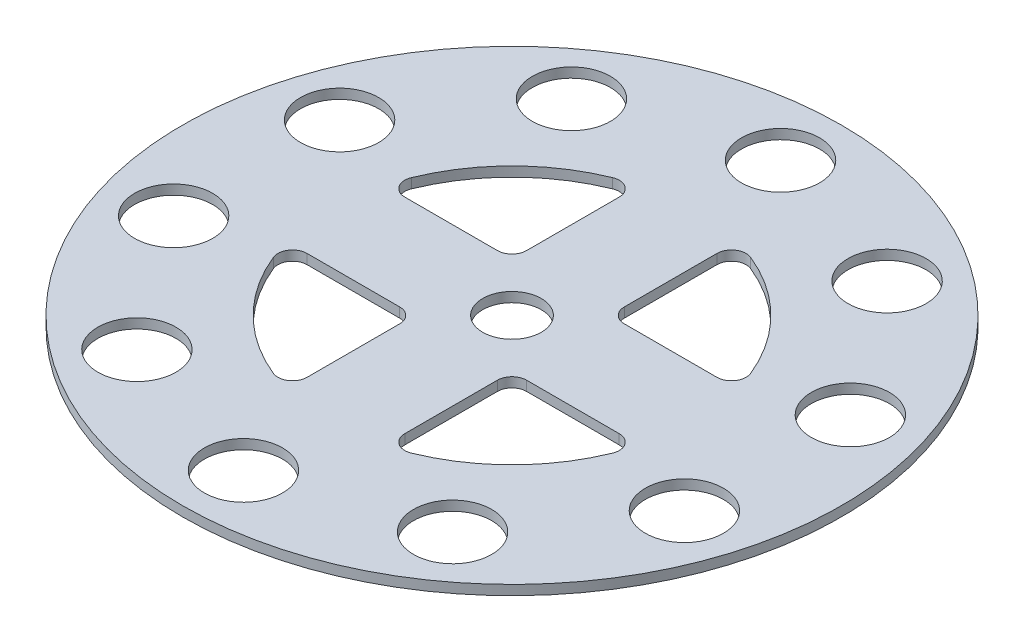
from build123d import *

# Parameters (mm, degrees)
SKETCH1_R           = 67.5
BOSS_EXTRUDE1_DEPTH = 2
SKETCH2_R           = 8
CUT_EXTRUDE1_DEPTH  = 96.480364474
CIRPATTERN1_COUNT   = 10
SKETCH3_R           = 6
CUT_EXTRUDE2_DEPTH  = 96.480364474
FILLET1_R           = 3


with BuildPart() as part:
    # Sketch1 → Boss-Extrude1 (new body)
    with BuildSketch(Plane(origin=(0, 0, 0), x_dir=(1, 0, 0), z_dir=(0, 1, 0))):
        with Locations(Location((0, 0, 0), (0, 0, 270))):
            Circle(SKETCH1_R)
        with BuildLine():
            Line((-10, 36.142080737), (-10, 10))
            Line((-10, 10), (-36.142080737, 10))
            ThreePointArc((-36.142080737, 10), (-26.516504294, 26.516504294), (-10, 36.142080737))
        make_face(mode=Mode.SUBTRACT)
        with BuildLine():
            Line((10, 36.142080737), (10, 10))
            Line((10, 10), (36.142080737, 10))
            ThreePointArc((36.142080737, 10), (26.516504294, 26.516504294), (10, 36.142080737))
        make_face(mode=Mode.SUBTRACT)
        with BuildLine():
            Line((36.142080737, -10), (10, -10))
            Line((10, -10), (10, -36.142080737))
            ThreePointArc((10, -36.142080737), (26.516504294, -26.516504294), (36.142080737, -10))
        make_face(mode=Mode.SUBTRACT)
        with BuildLine():
            Line((-10, -10), (-10, -36.142080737))
            ThreePointArc((-10, -36.142080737), (-26.516504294, -26.516504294), (-36.142080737, -10))
            Line((-36.142080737, -10), (-10, -10))
        make_face(mode=Mode.SUBTRACT)
    extrude(amount=BOSS_EXTRUDE1_DEPTH)

    # Sketch2 → Cut-Extrude1 (cut, through all)
    with BuildSketch(Plane(origin=(0, 2, 0), x_dir=(1, 0, 0), z_dir=(0, 1, 0))):
        with Locations(Location((0, 55, 0), (0, 0, 270))):
            Circle(SKETCH2_R)
    cut_extrude1 = extrude(amount=-CUT_EXTRUDE1_DEPTH, mode=Mode.SUBTRACT)

    # CirPattern1: Cut-Extrude1 ×10 about axis
    cirpattern1_axis = Axis((0, 0, 0), (0, 1, 0))
    for i in range(1, CIRPATTERN1_COUNT):
        add(cut_extrude1.rotate(cirpattern1_axis, i * 360 / CIRPATTERN1_COUNT), mode=Mode.SUBTRACT)

    # Sketch3 → Cut-Extrude2 (cut, through all)
    with BuildSketch(Plane(origin=(0, 2, 0), x_dir=(1, 0, 0), z_dir=(0, 1, 0))):
        with Locations(Location((0, 0, 0), (0, 0, 270))):
            Circle(SKETCH3_R)
    extrude(amount=-CUT_EXTRUDE2_DEPTH, mode=Mode.SUBTRACT)

    # Fillet1
    fillet1_edges = [part.edges().sort_by_distance(p)[0] for p in [
        (-36.142080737, 1, 10),
        (-10, 1, 36.142080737),
        (-10, 1, 10),
        (10, 1, 10),
        (10, 1, 36.142080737),
        (36.142080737, 1, 10),
        (36.142080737, 1, -10),
        (10, 1, -36.142080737),
        (10, 1, -10),
        (-36.142080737, 1, -10),
        (-10, 1, -10),
        (-10, 1, -36.142080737),
    ]]
    fillet(fillet1_edges, radius=FILLET1_R)


solid = part.part
